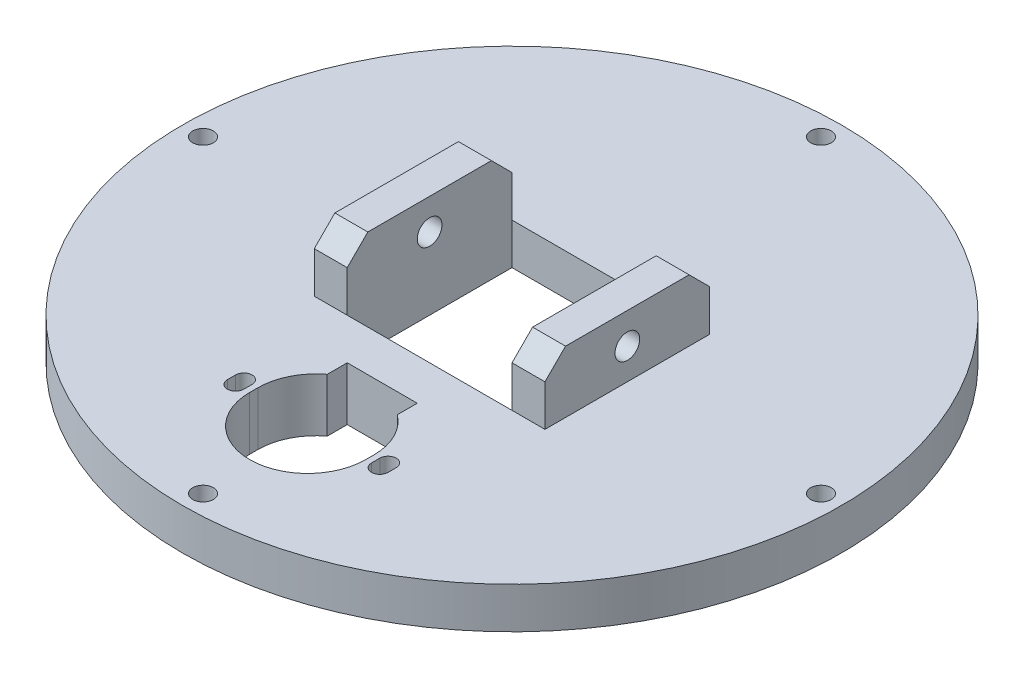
from build123d import *

# Parameters (mm, degrees)
SKETCH1_R               = 80
BOSS_EXTRUDE1_DEPTH     = 10
CUT_EXTRUDE1_REACH      = 115.578
SKETCH2_R               = 2.5
CUT_EXTRUDE2_REACH      = 115.578
SKETCH3_W               = 40
SKETCH3_H               = 40
CUT_EXTRUDE3_REACH      = 115.578
SKETCH4_W               = 17
SKETCH4_H               = 4.850111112
SKETCH5_W               = 8
SKETCH5_H               = 40
BOSS_EXTRUDE2_DEPTH     = 15
FILLET1_SIZE            = 5
CUT_EXTRUDE4_REACH      = 138.708
SKETCH6_R               = 3
FILLET1_OF_MIRROR1_SIZE = 5
BOSS_EXTRUDE3_DEPTH     = 3
FILLET2_R               = 10


with BuildPart() as part:
    # Sketch1 → Boss-Extrude1 (new body)
    with BuildSketch(Plane(origin=(0, 0, 0), x_dir=(1, 0, 0), z_dir=(0, 1, 0))):
        with Locations(Location((0, 0, 0), (0, 0, 270))):
            Circle(SKETCH1_R)
    extrude(amount=BOSS_EXTRUDE1_DEPTH)

    # Sketch2 → Cut-Extrude1 (cut, up to next)
    with BuildSketch(Plane(origin=(0, 10, 0), x_dir=(1, 0, 0), z_dir=(0, 1, 0)), mode=Mode.PRIVATE) as cut_extrude1_sk1:
        with Locations(Location((-75, 0, 0), (0, 0, 270))):
            Circle(SKETCH2_R)
    cut_extrude1_tool1 = extrude(cut_extrude1_sk1.sketch, amount=-CUT_EXTRUDE1_REACH, mode=Mode.PRIVATE) & part.part
    # Sketch2 → Cut-Extrude1 (cut, up to next)
    with BuildSketch(Plane(origin=(0, 10, 0), x_dir=(1, 0, 0), z_dir=(0, 1, 0)), mode=Mode.PRIVATE) as cut_extrude1_sk2:
        with Locations(Location((0, 75, 0), (0, 0, 270))):
            Circle(SKETCH2_R)
    cut_extrude1_tool2 = extrude(cut_extrude1_sk2.sketch, amount=-CUT_EXTRUDE1_REACH, mode=Mode.PRIVATE) & part.part
    # Sketch2 → Cut-Extrude1 (cut, up to next)
    with BuildSketch(Plane(origin=(0, 10, 0), x_dir=(1, 0, 0), z_dir=(0, 1, 0)), mode=Mode.PRIVATE) as cut_extrude1_sk3:
        with Locations(Location((75, 0, 0), (0, 0, 270))):
            Circle(SKETCH2_R)
    cut_extrude1_tool3 = extrude(cut_extrude1_sk3.sketch, amount=-CUT_EXTRUDE1_REACH, mode=Mode.PRIVATE) & part.part
    # Sketch2 → Cut-Extrude1 (cut, up to next)
    with BuildSketch(Plane(origin=(0, 10, 0), x_dir=(1, 0, 0), z_dir=(0, 1, 0)), mode=Mode.PRIVATE) as cut_extrude1_sk4:
        with Locations(Location((0, -75, 0), (0, 0, 270))):
            Circle(SKETCH2_R)
    cut_extrude1_tool4 = extrude(cut_extrude1_sk4.sketch, amount=-CUT_EXTRUDE1_REACH, mode=Mode.PRIVATE) & part.part
    add(cut_extrude1_tool1.solids().sort_by_distance((-75, 10, 0))[0], mode=Mode.SUBTRACT)
    add(cut_extrude1_tool2.solids().sort_by_distance((0, 10, -75))[0], mode=Mode.SUBTRACT)
    add(cut_extrude1_tool3.solids().sort_by_distance((75, 10, 0))[0], mode=Mode.SUBTRACT)
    add(cut_extrude1_tool4.solids().sort_by_distance((0, 10, 75))[0], mode=Mode.SUBTRACT)

    # Sketch3 → Cut-Extrude2 (cut, up to next)
    with BuildSketch(Plane(origin=(0, 10, 0), x_dir=(1, 0, 0), z_dir=(0, 1, 0)), mode=Mode.PRIVATE) as cut_extrude2_sk1:
        Rectangle(SKETCH3_W, SKETCH3_H)
    cut_extrude2_tool1 = extrude(cut_extrude2_sk1.sketch, amount=-CUT_EXTRUDE2_REACH, mode=Mode.PRIVATE) & part.part
    add(cut_extrude2_tool1.solids().sort_by_distance((0, 10, 0))[0], mode=Mode.SUBTRACT)

    # Sketch4 → Cut-Extrude3 (cut, up to next)
    with BuildSketch(Plane(origin=(0, 10, 0), x_dir=(1, 0, 0), z_dir=(0, 1, 0)), mode=Mode.PRIVATE) as cut_extrude3_sk1:
        with Locations((-1.5, -32.425055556)):
            Rectangle(SKETCH4_W, SKETCH4_H)
    cut_extrude3_tool1 = extrude(cut_extrude3_sk1.sketch, amount=-CUT_EXTRUDE3_REACH, mode=Mode.PRIVATE) & part.part
    # Sketch4 → Cut-Extrude3 (cut, up to next)
    with BuildSketch(Plane(origin=(0, 10, 0), x_dir=(1, 0, 0), z_dir=(0, 1, 0)), mode=Mode.PRIVATE) as cut_extrude3_sk2:
        with BuildLine():
            Line((12.6, -46.1), (12.6, -48.1))
            ThreePointArc((12.6, -48.1), (-1.5, -62.2), (-15.6, -48.1))
            Line((-15.6, -48.1), (-15.6, -46.1))
            ThreePointArc((-15.6, -46.1), (-1.5, -32), (12.6, -46.1))
        make_face()
    cut_extrude3_tool2 = extrude(cut_extrude3_sk2.sketch, amount=-CUT_EXTRUDE3_REACH, mode=Mode.PRIVATE) & part.part
    # Sketch4 → Cut-Extrude3 (cut, up to next)
    with BuildSketch(Plane(origin=(0, 10, 0), x_dir=(1, 0, 0), z_dir=(0, 1, 0)), mode=Mode.PRIVATE) as cut_extrude3_sk3:
        with BuildLine():
            Line((18, -46.1), (18, -48.1))
            ThreePointArc((18, -48.1), (16, -50.1), (14, -48.1))
            Line((14, -48.1), (14, -46.1))
            ThreePointArc((14, -46.1), (16, -44.1), (18, -46.1))
        make_face()
    cut_extrude3_tool3 = extrude(cut_extrude3_sk3.sketch, amount=-CUT_EXTRUDE3_REACH, mode=Mode.PRIVATE) & part.part
    # Sketch4 → Cut-Extrude3 (cut, up to next)
    with BuildSketch(Plane(origin=(0, 10, 0), x_dir=(1, 0, 0), z_dir=(0, 1, 0)), mode=Mode.PRIVATE) as cut_extrude3_sk4:
        with BuildLine():
            Line((-21, -46.1), (-21, -48.1))
            ThreePointArc((-21, -48.1), (-19, -50.1), (-17, -48.1))
            Line((-17, -48.1), (-17, -46.1))
            ThreePointArc((-17, -46.1), (-19, -44.1), (-21, -46.1))
        make_face()
    cut_extrude3_tool4 = extrude(cut_extrude3_sk4.sketch, amount=-CUT_EXTRUDE3_REACH, mode=Mode.PRIVATE) & part.part
    add(cut_extrude3_tool1.solids().sort_by_distance((-1.5, 10, 32.425056))[0], mode=Mode.SUBTRACT)
    add(cut_extrude3_tool2.solids().sort_by_distance((-1.5, 10, 47.1))[0], mode=Mode.SUBTRACT)
    add(cut_extrude3_tool3.solids().sort_by_distance((16, 10, 47.1))[0], mode=Mode.SUBTRACT)
    add(cut_extrude3_tool4.solids().sort_by_distance((-19, 10, 47.1))[0], mode=Mode.SUBTRACT)

    # Sketch5 → Boss-Extrude2 (add)
    with BuildSketch(Plane(origin=(0, 10, 0), x_dir=(1, 0, 0), z_dir=(0, 1, 0))):
        with Locations((-24, 0)):
            Rectangle(SKETCH5_W, SKETCH5_H)
    boss_extrude2 = extrude(amount=BOSS_EXTRUDE2_DEPTH)

    # Fillet1
    fillet1_edges = [part.edges().sort_by_distance(p)[0] for p in [
        (-24, 25, -20),
        (-24, 25, 20),
    ]]
    chamfer(fillet1_edges, length=FILLET1_SIZE)

    # Sketch6 → Cut-Extrude4 (cut, up to next)
    with BuildSketch(Plane.ZY.offset(28), mode=Mode.PRIVATE) as cut_extrude4_sk1:
        with Locations((0, 17.5)):
            Circle(SKETCH6_R)
    cut_extrude4_tool1 = extrude(cut_extrude4_sk1.sketch, amount=-CUT_EXTRUDE4_REACH, mode=Mode.PRIVATE) & part.part
    cut_extrude4 = cut_extrude4_tool1.solids().sort_by_distance((-28, 17.5, 0))[0]
    add(cut_extrude4, mode=Mode.SUBTRACT)

    # Mirror1: Boss-Extrude2, Cut-Extrude4 across plane
    add(boss_extrude2.mirror(Plane.ZY))
    add(cut_extrude4.mirror(Plane.ZY), mode=Mode.SUBTRACT)

    # Fillet1 of Mirror1
    fillet1_of_mirror1_edges = [part.edges().sort_by_distance(p)[0] for p in [
        (24, 25, -20),
        (24, 25, 20),
    ]]
    chamfer(fillet1_of_mirror1_edges, length=FILLET1_OF_MIRROR1_SIZE)

    # Sketch7 → Boss-Extrude3 (add)
    with BuildSketch(Plane.XZ):
        with BuildLine():
            Line((-26.5, 65), (-26.5, 45))
            Line((-26.5, 45), (-20.670329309, 45))
            ThreePointArc((-20.670329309, 45), (-20.915810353, 45.525830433), (-21, 46.1))
            Line((-21, 46.1), (-21, 48.1))
            ThreePointArc((-21, 48.1), (-19, 50.1), (-17, 48.1))
            Line((-17, 48.1), (-17, 46.1))
            ThreePointArc((-17, 46.1), (-17.084189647, 45.525830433), (-17.329670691, 45))
            Line((-17.329670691, 45), (-15.557026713, 45))
            ThreePointArc((-15.557026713, 45), (-15.589252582, 45.549580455), (-15.6, 46.1))
            Line((-15.6, 46.1), (-15.6, 48.1))
            ThreePointArc((-15.6, 48.1), (-11.470205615, 58.070205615), (-1.5, 62.2))
            Line((-1.5, 62.2), (-1.5, 65))
            Line((-1.5, 65), (-26.5, 65))
        make_face()
        with BuildLine():
            Line((17.670329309, 45), (23.5, 45))
            Line((23.5, 45), (23.5, 65))
            Line((23.5, 65), (-1.5, 65))
            Line((-1.5, 65), (-1.5, 62.2))
            ThreePointArc((-1.5, 62.2), (8.470205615, 58.070205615), (12.6, 48.1))
            Line((12.6, 48.1), (12.6, 46.1))
            ThreePointArc((12.6, 46.1), (12.589252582, 45.549580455), (12.557026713, 45))
            Line((12.557026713, 45), (14.329670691, 45))
            ThreePointArc((14.329670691, 45), (14.084189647, 45.525830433), (14, 46.1))
            Line((14, 46.1), (14, 48.1))
            ThreePointArc((14, 48.1), (16, 50.1), (18, 48.1))
            Line((18, 48.1), (18, 46.1))
            ThreePointArc((18, 46.1), (17.915810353, 45.525830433), (17.670329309, 45))
        make_face()
        with BuildLine():
            Line((-1.5, 30), (-1.5, 25))
            Line((-1.5, 25), (23.5, 25))
            Line((23.5, 25), (23.5, 45))
            Line((23.5, 45), (17.670329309, 45))
            ThreePointArc((17.670329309, 45), (16, 44.1), (14.329670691, 45))
            Line((14.329670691, 45), (12.557026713, 45))
            ThreePointArc((12.557026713, 45), (10.86769682, 39.328731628), (7, 34.850111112))
            Line((7, 34.850111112), (7, 30))
            Line((7, 30), (-1.5, 30))
        make_face()
        with BuildLine():
            Line((-26.5, 25), (-1.5, 25))
            Line((-1.5, 25), (-1.5, 30))
            Line((-1.5, 30), (-10, 30))
            Line((-10, 30), (-10, 34.850111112))
            ThreePointArc((-10, 34.850111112), (-13.86769682, 39.328731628), (-15.557026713, 45))
            Line((-15.557026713, 45), (-17.329670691, 45))
            ThreePointArc((-17.329670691, 45), (-19, 44.1), (-20.670329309, 45))
            Line((-20.670329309, 45), (-26.5, 45))
            Line((-26.5, 45), (-26.5, 25))
        make_face()
    extrude(amount=BOSS_EXTRUDE3_DEPTH)

    # Fillet2
    fillet2_edges = [part.edges().sort_by_distance(p)[0] for p in [
        (-26.5, -1.5, 25),
        (23.5, -1.5, 25),
        (23.5, -1.5, 65),
        (-26.5, -1.5, 65),
    ]]
    fillet(fillet2_edges, radius=FILLET2_R)


solid = part.part
